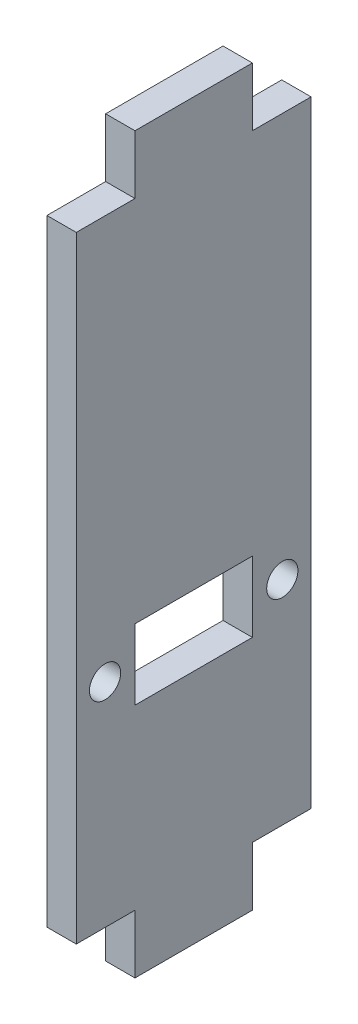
from build123d import *

# Parameters (mm, degrees)
SKETCH1_R      = 1.6891
SKETCH1_W      = 12.7
SKETCH1_H      = 7.62
EXTRUDE1_DEPTH = 3.175


with BuildPart() as part:
    # Sketch1 → Extrude1 (new body)
    with BuildSketch(Plane(origin=(0, 0, 0), x_dir=(0, 0, -1), z_dir=(1, 0, 0))):
        Polygon((-6.35, 0), (-6.35, 6.35), (-12.7, 6.35), (-12.7, 73.025), (-6.35, 73.025), (-6.35, 79.375), (6.35, 79.375), (6.35, 73.025), (12.7, 73.025), (12.7, 6.35), (6.35, 6.35), (6.35, 0), align=None)
        with Locations((-9.5885, 29.36875)):
            Circle(SKETCH1_R, mode=Mode.SUBTRACT)
        with Locations(Location((9.5885, 29.36875, 0), (0, 0, 180))):
            Circle(SKETCH1_R, mode=Mode.SUBTRACT)
        with Locations((0, 29.36875)):
            Rectangle(SKETCH1_W, SKETCH1_H, mode=Mode.SUBTRACT)
    extrude(amount=EXTRUDE1_DEPTH)


solid = part.part
